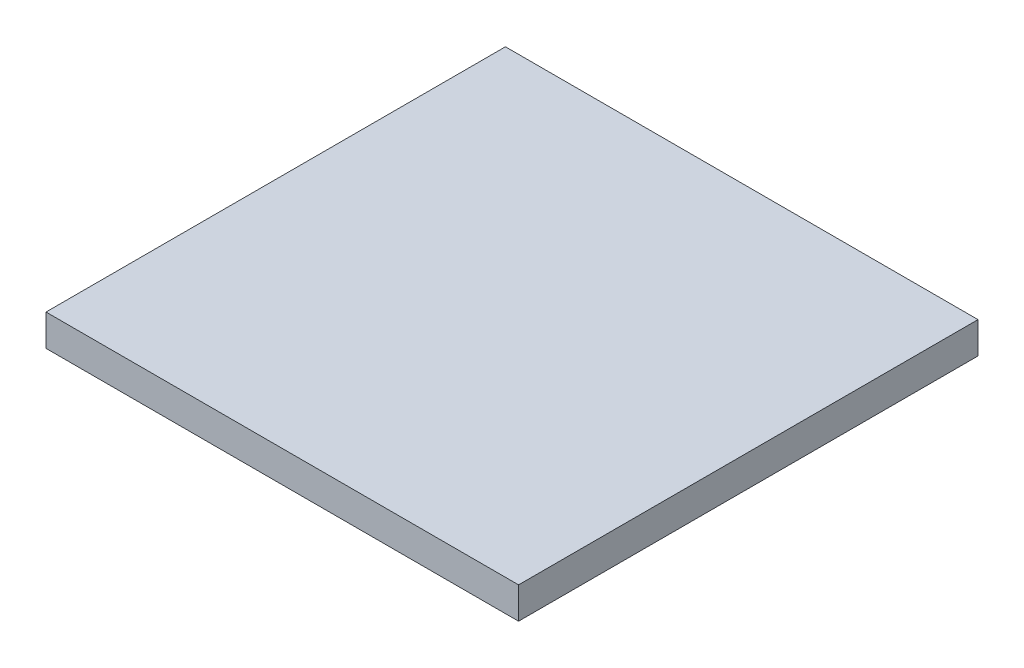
from build123d import *

# Parameters (mm, degrees)
ESQUISSE1_W        = 180
ESQUISSE1_H        = 175
BOSS_EXTRU_1_DEPTH = 12


with BuildPart() as part:
    # Esquisse1 → Boss.-Extru.1 (new body)
    with BuildSketch(Plane(origin=(0, 0, 0), x_dir=(1, 0, 0), z_dir=(0, 1, 0))):
        with Locations((90, 87.5)):
            Rectangle(ESQUISSE1_W, ESQUISSE1_H)
    extrude(amount=BOSS_EXTRU_1_DEPTH)


solid = part.part
